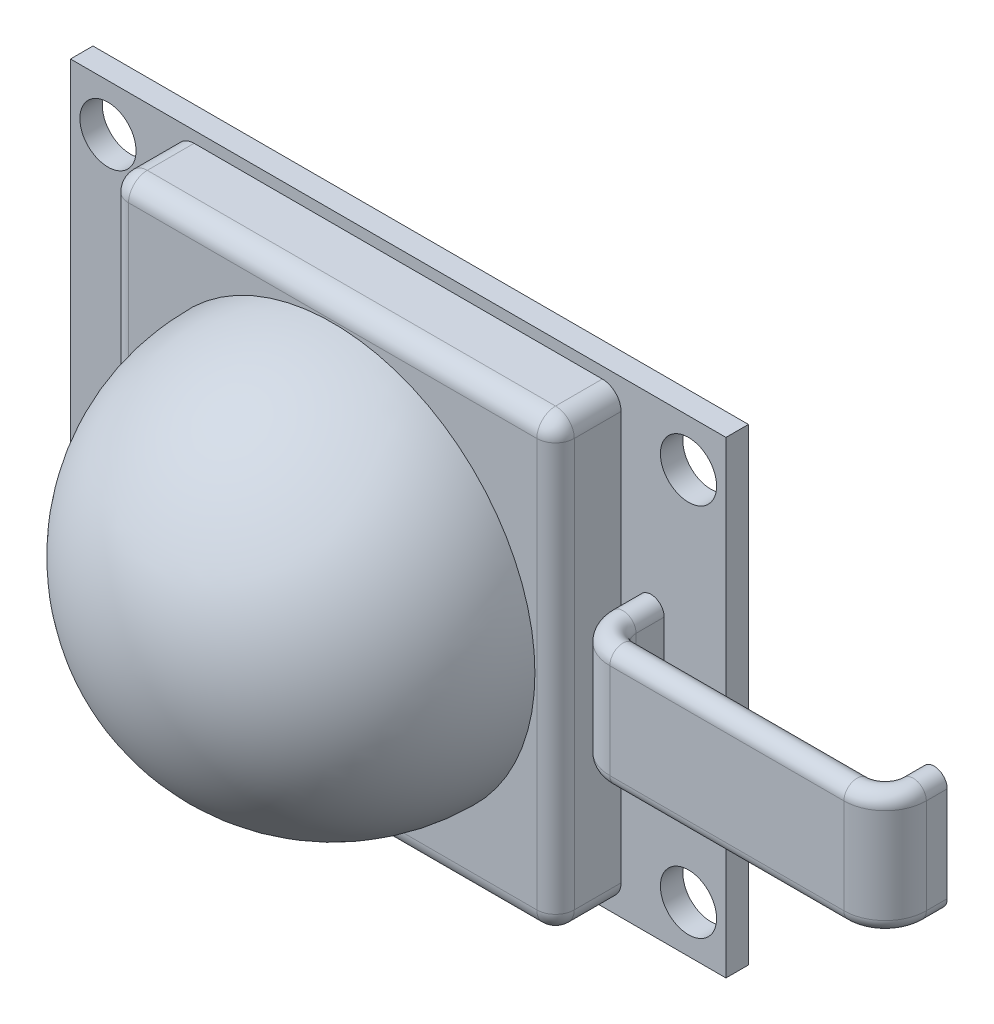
from build123d import *

# Parameters (mm, degrees)
ESQUISSE1_W      = 35
ESQUISSE1_H      = 25
ESQUISSE1_R      = 1.5
ESQUISSE1_R_2    = 0.4
EXTRUSION1_DEPTH = 1.2
EXTRUSION2_DEPTH = 3.5
CONG_1_R         = 1


with BuildPart() as part:
    # Esquisse1 → Extrusion1 (new body)
    with BuildSketch(Plane.XY):
        with Locations((17.5, 12.5)):
            Rectangle(ESQUISSE1_W, ESQUISSE1_H)
        with Locations((2, 2.5)):
            Circle(ESQUISSE1_R, mode=Mode.SUBTRACT)
        with Locations(Location((33, 2.5, 0), (0, 0, 180))):
            Circle(ESQUISSE1_R, mode=Mode.SUBTRACT)
        with Locations((33, 22.5)):
            Circle(ESQUISSE1_R, mode=Mode.SUBTRACT)
        with Locations(Location((2, 22.5, 0), (0, 0, 180))):
            Circle(ESQUISSE1_R, mode=Mode.SUBTRACT)
        with Locations((31, 12.5)):
            Circle(ESQUISSE1_R_2, mode=Mode.SUBTRACT)
        with Locations((31, 15.04)):
            Circle(ESQUISSE1_R_2, mode=Mode.SUBTRACT)
        with Locations(Location((31, 9.96, 0), (0, 0, 180))):
            Circle(ESQUISSE1_R_2, mode=Mode.SUBTRACT)
    extrude(amount=EXTRUSION1_DEPTH)

    # Esquisse2 → Extrusion2 (add)
    with BuildSketch(Plane.XY.offset(1.2)):
        with BuildLine():
            Line((6.6, 24.4), (28.4, 24.4))
            ThreePointArc((28.4, 24.4), (29.107106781, 24.107106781), (29.4, 23.4))
            Line((29.4, 23.4), (29.4, 1.6))
            ThreePointArc((29.4, 1.6), (29.107106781, 0.892893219), (28.4, 0.6))
            Line((28.4, 0.6), (6.6, 0.6))
            ThreePointArc((6.6, 0.6), (5.892893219, 0.892893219), (5.6, 1.6))
            Line((5.6, 1.6), (5.6, 23.4))
            ThreePointArc((5.6, 23.4), (5.892893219, 24.107106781), (6.6, 24.4))
        make_face()
    extrude(amount=EXTRUSION2_DEPTH)

    # Cong_1
    cong_1_edges = [part.edges().sort_by_distance(p)[0] for p in [
        (29.107106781, 24.107106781, 4.7),
        (17.5, 24.4, 4.7),
        (5.892893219, 24.107106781, 4.7),
        (5.6, 12.5, 4.7),
        (5.892893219, 0.892893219, 4.7),
        (17.5, 0.6, 4.7),
        (29.107106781, 0.892893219, 4.7),
        (29.4, 12.5, 4.7),
    ]]
    fillet(cong_1_edges, radius=CONG_1_R)

    # Esquisse3 → R_vol.-Mince1 (revolve)
    with BuildSketch(Plane(origin=(0, 12.5, 0), x_dir=(-1, 0, 0), z_dir=(0, 1, 0))):
        with BuildLine():
            ThreePointArc((-17.5, 15.5), (-25.136753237, 12.336753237), (-28.3, 4.7))
            Line((-28.3, 4.7), (-28.2999, 4.7))
            ThreePointArc((-28.2999, 4.7), (-25.136682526, 12.336682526), (-17.5, 15.4999))
            Line((-17.5, 15.4999), (-17.5, 15.5))
        make_face()
    revolve(axis=Axis((17.5, 12.5, -1.665550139), (0, 0, 1)))

    # Balayage1: sweep along a path in Esquisse5
    with BuildLine(Plane.XZ.offset(-12.498360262)) as balayage1_path:
        Line((31, 1.2), (31, 2.7))
        ThreePointArc((31, 2.7), (31.439339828, 3.760660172), (32.5, 4.2))
        Line((32.5, 4.2), (45.00042, 4.2))
        ThreePointArc((45.00042, 4.2), (46.061080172, 3.760660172), (46.50042, 2.7))
        Line((46.50042, 2.7), (46.50042, 1.58537732))
    # Esquisse4 → Balayage1 (sweep)
    with BuildSketch(Plane.XY.offset(1.2)):
        with BuildLine():
            Line((31.7, 15.04), (31.7, 9.96))
            ThreePointArc((31.7, 9.96), (31, 9.26), (30.3, 9.96))
            Line((30.3, 9.96), (30.3, 15.04))
            ThreePointArc((30.3, 15.04), (31, 15.74), (31.7, 15.04))
        make_face()
    sweep(path=balayage1_path.line)


solid = part.part
